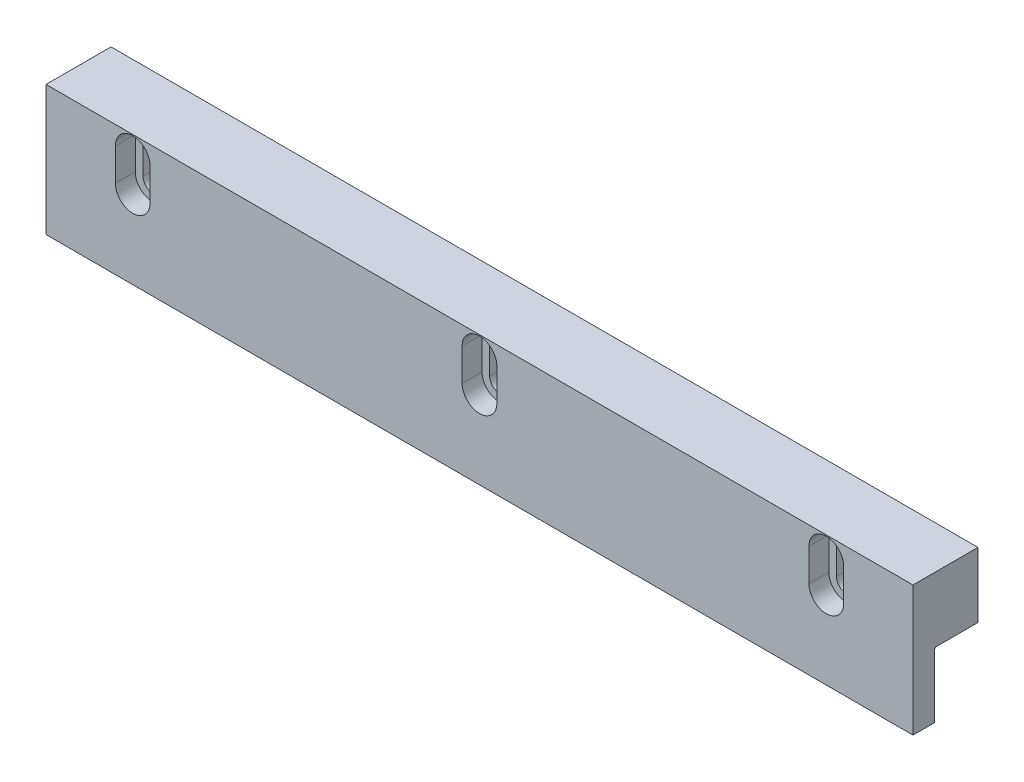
ISO-10303-21;
HEADER;
FILE_DESCRIPTION(('STEP AP214'),'2;1');
FILE_NAME('part.step','',(''),(''),'','','');
FILE_SCHEMA(('AUTOMOTIVE_DESIGN { 1 0 10303 214 1 1 1 1 }'));
ENDSEC;
DATA;
#1=APPLICATION_CONTEXT('core data for automotive mechanical design processes');
#2=APPLICATION_PROTOCOL_DEFINITION('international standard','automotive_design',2000,#1);
#3=PRODUCT_CONTEXT('',#1,'mechanical');
#4=PRODUCT('Part','Part','',(#3));
#5=PRODUCT_RELATED_PRODUCT_CATEGORY('part','',(#4));
#6=PRODUCT_DEFINITION_FORMATION('','',#4);
#7=PRODUCT_DEFINITION_CONTEXT('part definition',#1,'design');
#8=PRODUCT_DEFINITION('design','',#6,#7);
#9=PRODUCT_DEFINITION_SHAPE('','',#8);
#10=(LENGTH_UNIT() NAMED_UNIT(*) SI_UNIT(.MILLI.,.METRE.));
#11=(NAMED_UNIT(*) PLANE_ANGLE_UNIT() SI_UNIT($,.RADIAN.));
#12=(NAMED_UNIT(*) SI_UNIT($,.STERADIAN.) SOLID_ANGLE_UNIT());
#13=UNCERTAINTY_MEASURE_WITH_UNIT(LENGTH_MEASURE(1.E-05),#10,'distance_accuracy_value','');
#14=(GEOMETRIC_REPRESENTATION_CONTEXT(3) GLOBAL_UNCERTAINTY_ASSIGNED_CONTEXT((#13)) GLOBAL_UNIT_ASSIGNED_CONTEXT((#10,
#11,#12)) REPRESENTATION_CONTEXT('',''));
#15=CARTESIAN_POINT('',(0.,0.,0.));
#16=DIRECTION('',(0.,0.,1.));
#17=DIRECTION('',(1.,0.,0.));
#18=AXIS2_PLACEMENT_3D('',#15,#16,#17);
#19=CARTESIAN_POINT('',(0.,0.,15.));
#20=DIRECTION('',(0.,0.,1.));
#21=DIRECTION('',(1.,0.,0.));
#22=AXIS2_PLACEMENT_3D('',#19,#20,#21);
#23=PLANE('',#22);
#24=DIRECTION('',(0.,-1.,0.));
#25=VECTOR('',#24,1.);
#26=CARTESIAN_POINT('',(53.3117965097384,43.,15.));
#27=LINE('',#26,#25);
#28=CARTESIAN_POINT('',(53.3117965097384,43.,15.));
#29=VERTEX_POINT('',#28);
#30=CARTESIAN_POINT('',(53.3117965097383,13.,15.));
#31=VERTEX_POINT('',#30);
#32=EDGE_CURVE('E414',#29,#31,#27,.T.);
#33=ORIENTED_EDGE('',*,*,#32,.T.);
#34=DIRECTION('',(1.,0.,0.));
#35=VECTOR('',#34,1.);
#36=CARTESIAN_POINT('',(53.3117965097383,13.,15.));
#37=LINE('',#36,#35);
#38=CARTESIAN_POINT('',(253.311796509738,13.,15.));
#39=VERTEX_POINT('',#38);
#40=EDGE_CURVE('E417',#31,#39,#37,.T.);
#41=ORIENTED_EDGE('',*,*,#40,.T.);
#42=DIRECTION('',(0.,1.,0.));
#43=VECTOR('',#42,1.);
#44=CARTESIAN_POINT('',(253.311796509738,43.,15.));
#45=LINE('',#44,#43);
#46=CARTESIAN_POINT('',(253.311796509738,43.,15.));
#47=VERTEX_POINT('',#46);
#48=EDGE_CURVE('E420',#39,#47,#45,.T.);
#49=ORIENTED_EDGE('',*,*,#48,.T.);
#50=DIRECTION('',(-1.,0.,0.));
#51=VECTOR('',#50,1.);
#52=CARTESIAN_POINT('',(53.3117965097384,43.,15.));
#53=LINE('',#52,#51);
#54=EDGE_CURVE('E422',#47,#29,#53,.T.);
#55=ORIENTED_EDGE('',*,*,#54,.T.);
#56=EDGE_LOOP('',(#33,#41,#49,#55));
#57=FACE_BOUND('',#56,.T.);
#58=CARTESIAN_POINT('',(233.311796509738,38.75,15.));
#59=DIRECTION('',(0.,0.,1.));
#60=DIRECTION('',(1.,0.,0.));
#61=AXIS2_PLACEMENT_3D('',#58,#59,#60);
#62=CIRCLE('',#61,4.);
#63=CARTESIAN_POINT('',(237.311796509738,38.75,15.));
#64=VERTEX_POINT('',#63);
#65=CARTESIAN_POINT('',(229.311796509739,38.75,15.));
#66=VERTEX_POINT('',#65);
#67=EDGE_CURVE('E363',#64,#66,#62,.T.);
#68=ORIENTED_EDGE('',*,*,#67,.F.);
#69=DIRECTION('',(0.,-1.,0.));
#70=VECTOR('',#69,1.);
#71=CARTESIAN_POINT('',(237.311796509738,38.75,15.));
#72=LINE('',#71,#70);
#73=CARTESIAN_POINT('',(237.311796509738,31.25,15.));
#74=VERTEX_POINT('',#73);
#75=EDGE_CURVE('E351',#64,#74,#72,.T.);
#76=ORIENTED_EDGE('',*,*,#75,.T.);
#77=CARTESIAN_POINT('',(233.311796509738,31.25,15.));
#78=DIRECTION('',(0.,0.,1.));
#79=DIRECTION('',(1.,0.,0.));
#80=AXIS2_PLACEMENT_3D('',#77,#78,#79);
#81=CIRCLE('',#80,4.);
#82=CARTESIAN_POINT('',(229.311796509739,31.25,15.));
#83=VERTEX_POINT('',#82);
#84=EDGE_CURVE('E384',#83,#74,#81,.T.);
#85=ORIENTED_EDGE('',*,*,#84,.F.);
#86=DIRECTION('',(0.,-1.,0.));
#87=VECTOR('',#86,1.);
#88=CARTESIAN_POINT('',(229.311796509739,38.75,15.));
#89=LINE('',#88,#87);
#90=EDGE_CURVE('E334',#66,#83,#89,.T.);
#91=ORIENTED_EDGE('',*,*,#90,.F.);
#92=EDGE_LOOP('',(#68,#76,#85,#91));
#93=FACE_BOUND('',#92,.T.);
#94=CARTESIAN_POINT('',(153.311796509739,38.75,15.));
#95=DIRECTION('',(0.,0.,1.));
#96=DIRECTION('',(1.,0.,0.));
#97=AXIS2_PLACEMENT_3D('',#94,#95,#96);
#98=CIRCLE('',#97,4.);
#99=CARTESIAN_POINT('',(157.311796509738,38.75,15.));
#100=VERTEX_POINT('',#99);
#101=CARTESIAN_POINT('',(149.311796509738,38.75,15.));
#102=VERTEX_POINT('',#101);
#103=EDGE_CURVE('E299',#100,#102,#98,.T.);
#104=ORIENTED_EDGE('',*,*,#103,.F.);
#105=DIRECTION('',(0.,-1.,0.));
#106=VECTOR('',#105,1.);
#107=CARTESIAN_POINT('',(157.311796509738,38.75,15.));
#108=LINE('',#107,#106);
#109=CARTESIAN_POINT('',(157.311796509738,31.25,15.));
#110=VERTEX_POINT('',#109);
#111=EDGE_CURVE('E287',#100,#110,#108,.T.);
#112=ORIENTED_EDGE('',*,*,#111,.T.);
#113=CARTESIAN_POINT('',(153.311796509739,31.25,15.));
#114=DIRECTION('',(0.,0.,1.));
#115=DIRECTION('',(1.,0.,0.));
#116=AXIS2_PLACEMENT_3D('',#113,#114,#115);
#117=CIRCLE('',#116,4.);
#118=CARTESIAN_POINT('',(149.311796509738,31.25,15.));
#119=VERTEX_POINT('',#118);
#120=EDGE_CURVE('E320',#119,#110,#117,.T.);
#121=ORIENTED_EDGE('',*,*,#120,.F.);
#122=DIRECTION('',(0.,-1.,0.));
#123=VECTOR('',#122,1.);
#124=CARTESIAN_POINT('',(149.311796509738,38.75,15.));
#125=LINE('',#124,#123);
#126=EDGE_CURVE('E270',#102,#119,#125,.T.);
#127=ORIENTED_EDGE('',*,*,#126,.F.);
#128=EDGE_LOOP('',(#104,#112,#121,#127));
#129=FACE_BOUND('',#128,.T.);
#130=CARTESIAN_POINT('',(73.3117965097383,38.75,15.));
#131=DIRECTION('',(0.,0.,1.));
#132=DIRECTION('',(1.,0.,0.));
#133=AXIS2_PLACEMENT_3D('',#130,#131,#132);
#134=CIRCLE('',#133,4.);
#135=CARTESIAN_POINT('',(77.3117965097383,38.75,15.));
#136=VERTEX_POINT('',#135);
#137=CARTESIAN_POINT('',(69.3117965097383,38.75,15.));
#138=VERTEX_POINT('',#137);
#139=EDGE_CURVE('E31',#136,#138,#134,.T.);
#140=ORIENTED_EDGE('',*,*,#139,.F.);
#141=DIRECTION('',(0.,-1.,0.));
#142=VECTOR('',#141,1.);
#143=CARTESIAN_POINT('',(77.3117965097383,38.75,15.));
#144=LINE('',#143,#142);
#145=CARTESIAN_POINT('',(77.3117965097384,31.25,15.));
#146=VERTEX_POINT('',#145);
#147=EDGE_CURVE('E222',#136,#146,#144,.T.);
#148=ORIENTED_EDGE('',*,*,#147,.T.);
#149=CARTESIAN_POINT('',(73.3117965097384,31.25,15.));
#150=DIRECTION('',(0.,0.,1.));
#151=DIRECTION('',(1.,0.,0.));
#152=AXIS2_PLACEMENT_3D('',#149,#150,#151);
#153=CIRCLE('',#152,4.);
#154=CARTESIAN_POINT('',(69.3117965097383,31.25,15.));
#155=VERTEX_POINT('',#154);
#156=EDGE_CURVE('E258',#155,#146,#153,.T.);
#157=ORIENTED_EDGE('',*,*,#156,.F.);
#158=DIRECTION('',(0.,-1.,0.));
#159=VECTOR('',#158,1.);
#160=CARTESIAN_POINT('',(69.3117965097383,38.75,15.));
#161=LINE('',#160,#159);
#162=EDGE_CURVE('E239',#138,#155,#161,.T.);
#163=ORIENTED_EDGE('',*,*,#162,.F.);
#164=EDGE_LOOP('',(#140,#148,#157,#163));
#165=FACE_BOUND('',#164,.T.);
#166=ADVANCED_FACE('F16',(#57,#93,#129,#165),#23,.T.);
#167=CARTESIAN_POINT('',(0.,0.,0.));
#168=DIRECTION('',(0.,0.,1.));
#169=DIRECTION('',(1.,0.,0.));
#170=AXIS2_PLACEMENT_3D('',#167,#168,#169);
#171=PLANE('',#170);
#172=DIRECTION('',(0.,-1.,0.));
#173=VECTOR('',#172,1.);
#174=CARTESIAN_POINT('',(155.561796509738,38.75,0.));
#175=LINE('',#174,#173);
#176=CARTESIAN_POINT('',(155.561796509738,38.75,0.));
#177=VERTEX_POINT('',#176);
#178=CARTESIAN_POINT('',(155.561796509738,31.25,0.));
#179=VERTEX_POINT('',#178);
#180=EDGE_CURVE('E279',#177,#179,#175,.T.);
#181=ORIENTED_EDGE('',*,*,#180,.F.);
#182=CARTESIAN_POINT('',(153.311796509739,38.75,0.));
#183=DIRECTION('',(0.,0.,1.));
#184=DIRECTION('',(1.,0.,0.));
#185=AXIS2_PLACEMENT_3D('',#182,#183,#184);
#186=CIRCLE('',#185,2.25);
#187=CARTESIAN_POINT('',(151.061796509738,38.75,0.));
#188=VERTEX_POINT('',#187);
#189=EDGE_CURVE('E307',#177,#188,#186,.T.);
#190=ORIENTED_EDGE('',*,*,#189,.T.);
#191=DIRECTION('',(0.,-1.,0.));
#192=VECTOR('',#191,1.);
#193=CARTESIAN_POINT('',(151.061796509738,38.75,0.));
#194=LINE('',#193,#192);
#195=CARTESIAN_POINT('',(151.061796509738,31.25,0.));
#196=VERTEX_POINT('',#195);
#197=EDGE_CURVE('E276',#188,#196,#194,.T.);
#198=ORIENTED_EDGE('',*,*,#197,.T.);
#199=CARTESIAN_POINT('',(153.311796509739,31.25,0.));
#200=DIRECTION('',(0.,0.,1.));
#201=DIRECTION('',(1.,0.,0.));
#202=AXIS2_PLACEMENT_3D('',#199,#200,#201);
#203=CIRCLE('',#202,2.25);
#204=EDGE_CURVE('E328',#196,#179,#203,.T.);
#205=ORIENTED_EDGE('',*,*,#204,.T.);
#206=EDGE_LOOP('',(#181,#190,#198,#205));
#207=FACE_BOUND('',#206,.T.);
#208=DIRECTION('',(0.,1.,0.));
#209=VECTOR('',#208,1.);
#210=CARTESIAN_POINT('',(253.311796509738,43.,0.));
#211=LINE('',#210,#209);
#212=CARTESIAN_POINT('',(253.311796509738,28.,0.));
#213=VERTEX_POINT('',#212);
#214=CARTESIAN_POINT('',(253.311796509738,43.,0.));
#215=VERTEX_POINT('',#214);
#216=EDGE_CURVE('E427',#213,#215,#211,.T.);
#217=ORIENTED_EDGE('',*,*,#216,.F.);
#218=DIRECTION('',(1.,0.,0.));
#219=VECTOR('',#218,1.);
#220=CARTESIAN_POINT('',(53.3117965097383,28.,0.));
#221=LINE('',#220,#219);
#222=CARTESIAN_POINT('',(53.3117965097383,28.,0.));
#223=VERTEX_POINT('',#222);
#224=EDGE_CURVE('E405',#223,#213,#221,.T.);
#225=ORIENTED_EDGE('',*,*,#224,.F.);
#226=DIRECTION('',(0.,-1.,0.));
#227=VECTOR('',#226,1.);
#228=CARTESIAN_POINT('',(53.3117965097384,43.,0.));
#229=LINE('',#228,#227);
#230=CARTESIAN_POINT('',(53.3117965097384,43.,0.));
#231=VERTEX_POINT('',#230);
#232=EDGE_CURVE('E412',#231,#223,#229,.T.);
#233=ORIENTED_EDGE('',*,*,#232,.F.);
#234=DIRECTION('',(-1.,0.,0.));
#235=VECTOR('',#234,1.);
#236=CARTESIAN_POINT('',(53.3117965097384,43.,0.));
#237=LINE('',#236,#235);
#238=EDGE_CURVE('E418',#215,#231,#237,.T.);
#239=ORIENTED_EDGE('',*,*,#238,.F.);
#240=EDGE_LOOP('',(#217,#225,#233,#239));
#241=FACE_BOUND('',#240,.T.);
#242=DIRECTION('',(0.,-1.,0.));
#243=VECTOR('',#242,1.);
#244=CARTESIAN_POINT('',(235.561796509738,38.75,0.));
#245=LINE('',#244,#243);
#246=CARTESIAN_POINT('',(235.561796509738,38.75,0.));
#247=VERTEX_POINT('',#246);
#248=CARTESIAN_POINT('',(235.561796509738,31.25,0.));
#249=VERTEX_POINT('',#248);
#250=EDGE_CURVE('E343',#247,#249,#245,.T.);
#251=ORIENTED_EDGE('',*,*,#250,.F.);
#252=CARTESIAN_POINT('',(233.311796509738,38.75,0.));
#253=DIRECTION('',(0.,0.,1.));
#254=DIRECTION('',(1.,0.,0.));
#255=AXIS2_PLACEMENT_3D('',#252,#253,#254);
#256=CIRCLE('',#255,2.25);
#257=CARTESIAN_POINT('',(231.061796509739,38.75,0.));
#258=VERTEX_POINT('',#257);
#259=EDGE_CURVE('E371',#247,#258,#256,.T.);
#260=ORIENTED_EDGE('',*,*,#259,.T.);
#261=DIRECTION('',(0.,-1.,0.));
#262=VECTOR('',#261,1.);
#263=CARTESIAN_POINT('',(231.061796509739,38.75,0.));
#264=LINE('',#263,#262);
#265=CARTESIAN_POINT('',(231.061796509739,31.25,0.));
#266=VERTEX_POINT('',#265);
#267=EDGE_CURVE('E340',#258,#266,#264,.T.);
#268=ORIENTED_EDGE('',*,*,#267,.T.);
#269=CARTESIAN_POINT('',(233.311796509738,31.25,0.));
#270=DIRECTION('',(0.,0.,1.));
#271=DIRECTION('',(1.,0.,0.));
#272=AXIS2_PLACEMENT_3D('',#269,#270,#271);
#273=CIRCLE('',#272,2.25);
#274=EDGE_CURVE('E392',#266,#249,#273,.T.);
#275=ORIENTED_EDGE('',*,*,#274,.T.);
#276=EDGE_LOOP('',(#251,#260,#268,#275));
#277=FACE_BOUND('',#276,.T.);
#278=DIRECTION('',(0.,-1.,0.));
#279=VECTOR('',#278,1.);
#280=CARTESIAN_POINT('',(75.5617965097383,38.75,0.));
#281=LINE('',#280,#279);
#282=CARTESIAN_POINT('',(75.5617965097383,38.75,0.));
#283=VERTEX_POINT('',#282);
#284=CARTESIAN_POINT('',(75.5617965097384,31.25,0.));
#285=VERTEX_POINT('',#284);
#286=EDGE_CURVE('E488',#283,#285,#281,.T.);
#287=ORIENTED_EDGE('',*,*,#286,.F.);
#288=CARTESIAN_POINT('',(73.3117965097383,38.75,0.));
#289=DIRECTION('',(0.,0.,1.));
#290=DIRECTION('',(1.,0.,0.));
#291=AXIS2_PLACEMENT_3D('',#288,#289,#290);
#292=CIRCLE('',#291,2.25);
#293=CARTESIAN_POINT('',(71.0617965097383,38.75,0.));
#294=VERTEX_POINT('',#293);
#295=EDGE_CURVE('E248',#283,#294,#292,.T.);
#296=ORIENTED_EDGE('',*,*,#295,.T.);
#297=DIRECTION('',(0.,-1.,0.));
#298=VECTOR('',#297,1.);
#299=CARTESIAN_POINT('',(71.0617965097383,38.75,0.));
#300=LINE('',#299,#298);
#301=CARTESIAN_POINT('',(71.0617965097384,31.25,0.));
#302=VERTEX_POINT('',#301);
#303=EDGE_CURVE('E493',#294,#302,#300,.T.);
#304=ORIENTED_EDGE('',*,*,#303,.T.);
#305=CARTESIAN_POINT('',(73.3117965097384,31.25,0.));
#306=DIRECTION('',(0.,0.,1.));
#307=DIRECTION('',(1.,0.,0.));
#308=AXIS2_PLACEMENT_3D('',#305,#306,#307);
#309=CIRCLE('',#308,2.25);
#310=EDGE_CURVE('E39',#302,#285,#309,.T.);
#311=ORIENTED_EDGE('',*,*,#310,.T.);
#312=EDGE_LOOP('',(#287,#296,#304,#311));
#313=FACE_BOUND('',#312,.T.);
#314=ADVANCED_FACE('F479',(#207,#241,#277,#313),#171,.F.);
#315=CARTESIAN_POINT('',(53.3117965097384,43.,15.));
#316=DIRECTION('',(1.,0.,0.));
#317=DIRECTION('',(0.,1.,0.));
#318=AXIS2_PLACEMENT_3D('',#315,#316,#317);
#319=PLANE('',#318);
#320=DIRECTION('',(0.,0.,1.));
#321=VECTOR('',#320,1.);
#322=CARTESIAN_POINT('',(53.3117965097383,28.,0.));
#323=LINE('',#322,#321);
#324=CARTESIAN_POINT('',(53.3117965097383,28.,9.5));
#325=VERTEX_POINT('',#324);
#326=EDGE_CURVE('E399',#223,#325,#323,.T.);
#327=ORIENTED_EDGE('',*,*,#326,.T.);
#328=CARTESIAN_POINT('',(53.3117965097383,27.5,9.5));
#329=DIRECTION('',(1.,0.,0.));
#330=DIRECTION('',(0.,1.,0.));
#331=AXIS2_PLACEMENT_3D('',#328,#329,#330);
#332=CIRCLE('',#331,0.5);
#333=CARTESIAN_POINT('',(53.3117965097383,27.5,10.));
#334=VERTEX_POINT('',#333);
#335=EDGE_CURVE('E11',#325,#334,#332,.T.);
#336=ORIENTED_EDGE('',*,*,#335,.T.);
#337=DIRECTION('',(0.,-1.,0.));
#338=VECTOR('',#337,1.);
#339=CARTESIAN_POINT('',(53.3117965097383,13.,10.));
#340=LINE('',#339,#338);
#341=CARTESIAN_POINT('',(53.3117965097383,13.,10.));
#342=VERTEX_POINT('',#341);
#343=EDGE_CURVE('E402',#334,#342,#340,.T.);
#344=ORIENTED_EDGE('',*,*,#343,.T.);
#345=DIRECTION('',(0.,0.,-1.));
#346=VECTOR('',#345,1.);
#347=CARTESIAN_POINT('',(53.3117965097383,13.,15.));
#348=LINE('',#347,#346);
#349=EDGE_CURVE('E438',#31,#342,#348,.T.);
#350=ORIENTED_EDGE('',*,*,#349,.F.);
#351=ORIENTED_EDGE('',*,*,#32,.F.);
#352=DIRECTION('',(0.,0.,-1.));
#353=VECTOR('',#352,1.);
#354=CARTESIAN_POINT('',(53.3117965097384,43.,15.));
#355=LINE('',#354,#353);
#356=EDGE_CURVE('E424',#29,#231,#355,.T.);
#357=ORIENTED_EDGE('',*,*,#356,.T.);
#358=ORIENTED_EDGE('',*,*,#232,.T.);
#359=EDGE_LOOP('',(#327,#336,#344,#350,#351,#357,#358));
#360=FACE_BOUND('',#359,.T.);
#361=ADVANCED_FACE('F459',(#360),#319,.F.);
#362=CARTESIAN_POINT('',(53.3117965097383,13.,15.));
#363=DIRECTION('',(0.,1.,0.));
#364=DIRECTION('',(0.,0.,1.));
#365=AXIS2_PLACEMENT_3D('',#362,#363,#364);
#366=PLANE('',#365);
#367=ORIENTED_EDGE('',*,*,#349,.T.);
#368=DIRECTION('',(1.,0.,0.));
#369=VECTOR('',#368,1.);
#370=CARTESIAN_POINT('',(53.3117965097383,13.,10.));
#371=LINE('',#370,#369);
#372=CARTESIAN_POINT('',(253.311796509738,13.,10.));
#373=VERTEX_POINT('',#372);
#374=EDGE_CURVE('E409',#342,#373,#371,.T.);
#375=ORIENTED_EDGE('',*,*,#374,.T.);
#376=DIRECTION('',(0.,0.,-1.));
#377=VECTOR('',#376,1.);
#378=CARTESIAN_POINT('',(253.311796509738,13.,15.));
#379=LINE('',#378,#377);
#380=EDGE_CURVE('E435',#39,#373,#379,.T.);
#381=ORIENTED_EDGE('',*,*,#380,.F.);
#382=ORIENTED_EDGE('',*,*,#40,.F.);
#383=EDGE_LOOP('',(#367,#375,#381,#382));
#384=FACE_BOUND('',#383,.T.);
#385=ADVANCED_FACE('F466',(#384),#366,.F.);
#386=CARTESIAN_POINT('',(253.311796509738,43.,15.));
#387=DIRECTION('',(-1.,0.,0.));
#388=DIRECTION('',(0.,0.,1.));
#389=AXIS2_PLACEMENT_3D('',#386,#387,#388);
#390=PLANE('',#389);
#391=ORIENTED_EDGE('',*,*,#380,.T.);
#392=DIRECTION('',(0.,-1.,0.));
#393=VECTOR('',#392,1.);
#394=CARTESIAN_POINT('',(253.311796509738,13.,10.));
#395=LINE('',#394,#393);
#396=CARTESIAN_POINT('',(253.311796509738,27.5,10.));
#397=VERTEX_POINT('',#396);
#398=EDGE_CURVE('E403',#397,#373,#395,.T.);
#399=ORIENTED_EDGE('',*,*,#398,.F.);
#400=CARTESIAN_POINT('',(253.311796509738,27.5,9.5));
#401=DIRECTION('',(-1.,0.,0.));
#402=DIRECTION('',(0.,0.,1.));
#403=AXIS2_PLACEMENT_3D('',#400,#401,#402);
#404=CIRCLE('',#403,0.5);
#405=CARTESIAN_POINT('',(253.311796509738,28.,9.5));
#406=VERTEX_POINT('',#405);
#407=EDGE_CURVE('E24',#397,#406,#404,.T.);
#408=ORIENTED_EDGE('',*,*,#407,.T.);
#409=DIRECTION('',(0.,0.,1.));
#410=VECTOR('',#409,1.);
#411=CARTESIAN_POINT('',(253.311796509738,28.,0.));
#412=LINE('',#411,#410);
#413=EDGE_CURVE('E398',#213,#406,#412,.T.);
#414=ORIENTED_EDGE('',*,*,#413,.F.);
#415=ORIENTED_EDGE('',*,*,#216,.T.);
#416=DIRECTION('',(0.,0.,-1.));
#417=VECTOR('',#416,1.);
#418=CARTESIAN_POINT('',(253.311796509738,43.,15.));
#419=LINE('',#418,#417);
#420=EDGE_CURVE('E432',#47,#215,#419,.T.);
#421=ORIENTED_EDGE('',*,*,#420,.F.);
#422=ORIENTED_EDGE('',*,*,#48,.F.);
#423=EDGE_LOOP('',(#391,#399,#408,#414,#415,#421,#422));
#424=FACE_BOUND('',#423,.T.);
#425=ADVANCED_FACE('F448',(#424),#390,.F.);
#426=CARTESIAN_POINT('',(53.3117965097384,43.,15.));
#427=DIRECTION('',(0.,-1.,0.));
#428=DIRECTION('',(0.,0.,-1.));
#429=AXIS2_PLACEMENT_3D('',#426,#427,#428);
#430=PLANE('',#429);
#431=ORIENTED_EDGE('',*,*,#238,.T.);
#432=ORIENTED_EDGE('',*,*,#356,.F.);
#433=ORIENTED_EDGE('',*,*,#54,.F.);
#434=ORIENTED_EDGE('',*,*,#420,.T.);
#435=EDGE_LOOP('',(#431,#432,#433,#434));
#436=FACE_BOUND('',#435,.T.);
#437=ADVANCED_FACE('F476',(#436),#430,.F.);
#438=CARTESIAN_POINT('',(53.3117965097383,13.,10.));
#439=DIRECTION('',(0.,0.,1.));
#440=DIRECTION('',(1.,0.,0.));
#441=AXIS2_PLACEMENT_3D('',#438,#439,#440);
#442=PLANE('',#441);
#443=ORIENTED_EDGE('',*,*,#343,.F.);
#444=DIRECTION('',(1.,0.,0.));
#445=VECTOR('',#444,1.);
#446=CARTESIAN_POINT('',(253.311796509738,27.5,10.));
#447=LINE('',#446,#445);
#448=EDGE_CURVE('E441',#334,#397,#447,.T.);
#449=ORIENTED_EDGE('',*,*,#448,.T.);
#450=ORIENTED_EDGE('',*,*,#398,.T.);
#451=ORIENTED_EDGE('',*,*,#374,.F.);
#452=EDGE_LOOP('',(#443,#449,#450,#451));
#453=FACE_BOUND('',#452,.T.);
#454=ADVANCED_FACE('F463',(#453),#442,.F.);
#455=CARTESIAN_POINT('',(53.3117965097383,28.,0.));
#456=DIRECTION('',(0.,1.,0.));
#457=DIRECTION('',(0.,0.,1.));
#458=AXIS2_PLACEMENT_3D('',#455,#456,#457);
#459=PLANE('',#458);
#460=ORIENTED_EDGE('',*,*,#413,.T.);
#461=DIRECTION('',(1.,0.,0.));
#462=VECTOR('',#461,1.);
#463=CARTESIAN_POINT('',(53.3117965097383,28.,9.5));
#464=LINE('',#463,#462);
#465=EDGE_CURVE('E444',#406,#325,#464,.F.);
#466=ORIENTED_EDGE('',*,*,#465,.T.);
#467=ORIENTED_EDGE('',*,*,#326,.F.);
#468=ORIENTED_EDGE('',*,*,#224,.T.);
#469=EDGE_LOOP('',(#460,#466,#467,#468));
#470=FACE_BOUND('',#469,.T.);
#471=ADVANCED_FACE('F454',(#470),#459,.F.);
#472=CARTESIAN_POINT('',(53.3117965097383,27.5,9.5));
#473=DIRECTION('',(-1.,0.,0.));
#474=DIRECTION('',(0.,0.,1.));
#475=AXIS2_PLACEMENT_3D('',#472,#473,#474);
#476=CYLINDRICAL_SURFACE('',#475,0.5);
#477=ORIENTED_EDGE('',*,*,#335,.F.);
#478=ORIENTED_EDGE('',*,*,#465,.F.);
#479=ORIENTED_EDGE('',*,*,#407,.F.);
#480=ORIENTED_EDGE('',*,*,#448,.F.);
#481=EDGE_LOOP('',(#477,#478,#479,#480));
#482=FACE_BOUND('',#481,.T.);
#483=ADVANCED_FACE('F18',(#482),#476,.F.);
#484=CARTESIAN_POINT('',(233.311796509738,31.25,15.));
#485=DIRECTION('',(0.,0.,1.));
#486=DIRECTION('',(1.,0.,0.));
#487=AXIS2_PLACEMENT_3D('',#484,#485,#486);
#488=CYLINDRICAL_SURFACE('',#487,2.25);
#489=CARTESIAN_POINT('',(233.311796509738,31.25,10.4));
#490=DIRECTION('',(0.,0.,1.));
#491=DIRECTION('',(1.,0.,0.));
#492=AXIS2_PLACEMENT_3D('',#489,#490,#491);
#493=CIRCLE('',#492,2.25);
#494=CARTESIAN_POINT('',(231.061796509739,31.25,10.4));
#495=VERTEX_POINT('',#494);
#496=CARTESIAN_POINT('',(235.561796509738,31.25,10.4));
#497=VERTEX_POINT('',#496);
#498=EDGE_CURVE('E389',#495,#497,#493,.T.);
#499=ORIENTED_EDGE('',*,*,#498,.T.);
#500=DIRECTION('',(0.,0.,-1.));
#501=VECTOR('',#500,1.);
#502=CARTESIAN_POINT('',(235.561796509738,31.25,0.));
#503=LINE('',#502,#501);
#504=EDGE_CURVE('E382',#497,#249,#503,.T.);
#505=ORIENTED_EDGE('',*,*,#504,.T.);
#506=ORIENTED_EDGE('',*,*,#274,.F.);
#507=DIRECTION('',(0.,0.,1.));
#508=VECTOR('',#507,1.);
#509=CARTESIAN_POINT('',(231.061796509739,31.25,15.));
#510=LINE('',#509,#508);
#511=EDGE_CURVE('E377',#495,#266,#510,.F.);
#512=ORIENTED_EDGE('',*,*,#511,.F.);
#513=EDGE_LOOP('',(#499,#505,#506,#512));
#514=FACE_BOUND('',#513,.T.);
#515=ADVANCED_FACE('F591',(#514),#488,.F.);
#516=CARTESIAN_POINT('',(235.561796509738,31.25,10.4));
#517=DIRECTION('',(0.,0.,-1.));
#518=DIRECTION('',(-1.,0.,0.));
#519=AXIS2_PLACEMENT_3D('',#516,#517,#518);
#520=PLANE('',#519);
#521=ORIENTED_EDGE('',*,*,#498,.F.);
#522=DIRECTION('',(0.,-1.,0.));
#523=VECTOR('',#522,1.);
#524=CARTESIAN_POINT('',(231.061796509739,38.75,10.4));
#525=LINE('',#524,#523);
#526=CARTESIAN_POINT('',(231.061796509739,38.75,10.4));
#527=VERTEX_POINT('',#526);
#528=EDGE_CURVE('E338',#527,#495,#525,.T.);
#529=ORIENTED_EDGE('',*,*,#528,.F.);
#530=CARTESIAN_POINT('',(233.311796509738,38.75,10.4));
#531=DIRECTION('',(0.,0.,1.));
#532=DIRECTION('',(1.,0.,0.));
#533=AXIS2_PLACEMENT_3D('',#530,#531,#532);
#534=CIRCLE('',#533,2.25);
#535=CARTESIAN_POINT('',(235.561796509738,38.75,10.4));
#536=VERTEX_POINT('',#535);
#537=EDGE_CURVE('E368',#536,#527,#534,.T.);
#538=ORIENTED_EDGE('',*,*,#537,.F.);
#539=DIRECTION('',(0.,-1.,0.));
#540=VECTOR('',#539,1.);
#541=CARTESIAN_POINT('',(235.561796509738,38.75,10.4));
#542=LINE('',#541,#540);
#543=EDGE_CURVE('E346',#536,#497,#542,.T.);
#544=ORIENTED_EDGE('',*,*,#543,.T.);
#545=EDGE_LOOP('',(#521,#529,#538,#544));
#546=FACE_BOUND('',#545,.T.);
#547=CARTESIAN_POINT('',(233.311796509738,31.25,10.4));
#548=DIRECTION('',(0.,0.,1.));
#549=DIRECTION('',(1.,0.,0.));
#550=AXIS2_PLACEMENT_3D('',#547,#548,#549);
#551=CIRCLE('',#550,4.);
#552=CARTESIAN_POINT('',(229.311796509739,31.25,10.4));
#553=VERTEX_POINT('',#552);
#554=CARTESIAN_POINT('',(237.311796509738,31.25,10.4));
#555=VERTEX_POINT('',#554);
#556=EDGE_CURVE('E386',#553,#555,#551,.T.);
#557=ORIENTED_EDGE('',*,*,#556,.T.);
#558=DIRECTION('',(0.,-1.,0.));
#559=VECTOR('',#558,1.);
#560=CARTESIAN_POINT('',(237.311796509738,38.75,10.4));
#561=LINE('',#560,#559);
#562=CARTESIAN_POINT('',(237.311796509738,38.75,10.4));
#563=VERTEX_POINT('',#562);
#564=EDGE_CURVE('E348',#563,#555,#561,.T.);
#565=ORIENTED_EDGE('',*,*,#564,.F.);
#566=CARTESIAN_POINT('',(233.311796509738,38.75,10.4));
#567=DIRECTION('',(0.,0.,1.));
#568=DIRECTION('',(1.,0.,0.));
#569=AXIS2_PLACEMENT_3D('',#566,#567,#568);
#570=CIRCLE('',#569,4.);
#571=CARTESIAN_POINT('',(229.311796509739,38.75,10.4));
#572=VERTEX_POINT('',#571);
#573=EDGE_CURVE('E365',#563,#572,#570,.T.);
#574=ORIENTED_EDGE('',*,*,#573,.T.);
#575=DIRECTION('',(0.,-1.,0.));
#576=VECTOR('',#575,1.);
#577=CARTESIAN_POINT('',(229.311796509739,38.75,10.4));
#578=LINE('',#577,#576);
#579=EDGE_CURVE('E336',#572,#553,#578,.T.);
#580=ORIENTED_EDGE('',*,*,#579,.T.);
#581=EDGE_LOOP('',(#557,#565,#574,#580));
#582=FACE_BOUND('',#581,.T.);
#583=ADVANCED_FACE('F598',(#546,#582),#520,.F.);
#584=CARTESIAN_POINT('',(233.311796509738,31.25,15.));
#585=DIRECTION('',(0.,0.,1.));
#586=DIRECTION('',(1.,0.,0.));
#587=AXIS2_PLACEMENT_3D('',#584,#585,#586);
#588=CYLINDRICAL_SURFACE('',#587,4.);
#589=ORIENTED_EDGE('',*,*,#84,.T.);
#590=DIRECTION('',(0.,0.,-1.));
#591=VECTOR('',#590,1.);
#592=CARTESIAN_POINT('',(237.311796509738,31.25,10.4));
#593=LINE('',#592,#591);
#594=EDGE_CURVE('E380',#74,#555,#593,.T.);
#595=ORIENTED_EDGE('',*,*,#594,.T.);
#596=ORIENTED_EDGE('',*,*,#556,.F.);
#597=DIRECTION('',(0.,0.,1.));
#598=VECTOR('',#597,1.);
#599=CARTESIAN_POINT('',(229.311796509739,31.25,15.));
#600=LINE('',#599,#598);
#601=EDGE_CURVE('E395',#83,#553,#600,.F.);
#602=ORIENTED_EDGE('',*,*,#601,.F.);
#603=EDGE_LOOP('',(#589,#595,#596,#602));
#604=FACE_BOUND('',#603,.T.);
#605=ADVANCED_FACE('F607',(#604),#588,.F.);
#606=CARTESIAN_POINT('',(233.311796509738,38.75,15.));
#607=DIRECTION('',(0.,0.,1.));
#608=DIRECTION('',(1.,0.,0.));
#609=AXIS2_PLACEMENT_3D('',#606,#607,#608);
#610=CYLINDRICAL_SURFACE('',#609,2.25);
#611=ORIENTED_EDGE('',*,*,#259,.F.);
#612=DIRECTION('',(0.,0.,-1.));
#613=VECTOR('',#612,1.);
#614=CARTESIAN_POINT('',(235.561796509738,38.75,0.));
#615=LINE('',#614,#613);
#616=EDGE_CURVE('E360',#536,#247,#615,.T.);
#617=ORIENTED_EDGE('',*,*,#616,.F.);
#618=ORIENTED_EDGE('',*,*,#537,.T.);
#619=DIRECTION('',(0.,0.,1.));
#620=VECTOR('',#619,1.);
#621=CARTESIAN_POINT('',(231.061796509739,38.75,15.));
#622=LINE('',#621,#620);
#623=EDGE_CURVE('E354',#258,#527,#622,.T.);
#624=ORIENTED_EDGE('',*,*,#623,.F.);
#625=EDGE_LOOP('',(#611,#617,#618,#624));
#626=FACE_BOUND('',#625,.T.);
#627=ADVANCED_FACE('F616',(#626),#610,.F.);
#628=CARTESIAN_POINT('',(233.311796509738,38.75,15.));
#629=DIRECTION('',(0.,0.,1.));
#630=DIRECTION('',(1.,0.,0.));
#631=AXIS2_PLACEMENT_3D('',#628,#629,#630);
#632=CYLINDRICAL_SURFACE('',#631,4.);
#633=ORIENTED_EDGE('',*,*,#573,.F.);
#634=DIRECTION('',(0.,0.,-1.));
#635=VECTOR('',#634,1.);
#636=CARTESIAN_POINT('',(237.311796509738,38.75,10.4));
#637=LINE('',#636,#635);
#638=EDGE_CURVE('E357',#64,#563,#637,.T.);
#639=ORIENTED_EDGE('',*,*,#638,.F.);
#640=ORIENTED_EDGE('',*,*,#67,.T.);
#641=DIRECTION('',(0.,0.,1.));
#642=VECTOR('',#641,1.);
#643=CARTESIAN_POINT('',(229.311796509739,38.75,15.));
#644=LINE('',#643,#642);
#645=EDGE_CURVE('E374',#572,#66,#644,.T.);
#646=ORIENTED_EDGE('',*,*,#645,.F.);
#647=EDGE_LOOP('',(#633,#639,#640,#646));
#648=FACE_BOUND('',#647,.T.);
#649=ADVANCED_FACE('F625',(#648),#632,.F.);
#650=CARTESIAN_POINT('',(237.311796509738,38.75,10.4));
#651=DIRECTION('',(-1.,0.,0.));
#652=DIRECTION('',(0.,0.,1.));
#653=AXIS2_PLACEMENT_3D('',#650,#651,#652);
#654=PLANE('',#653);
#655=ORIENTED_EDGE('',*,*,#594,.F.);
#656=ORIENTED_EDGE('',*,*,#75,.F.);
#657=ORIENTED_EDGE('',*,*,#638,.T.);
#658=ORIENTED_EDGE('',*,*,#564,.T.);
#659=EDGE_LOOP('',(#655,#656,#657,#658));
#660=FACE_BOUND('',#659,.T.);
#661=ADVANCED_FACE('F634',(#660),#654,.T.);
#662=CARTESIAN_POINT('',(235.561796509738,38.75,0.));
#663=DIRECTION('',(-1.,0.,0.));
#664=DIRECTION('',(0.,0.,1.));
#665=AXIS2_PLACEMENT_3D('',#662,#663,#664);
#666=PLANE('',#665);
#667=ORIENTED_EDGE('',*,*,#504,.F.);
#668=ORIENTED_EDGE('',*,*,#543,.F.);
#669=ORIENTED_EDGE('',*,*,#616,.T.);
#670=ORIENTED_EDGE('',*,*,#250,.T.);
#671=EDGE_LOOP('',(#667,#668,#669,#670));
#672=FACE_BOUND('',#671,.T.);
#673=ADVANCED_FACE('F643',(#672),#666,.T.);
#674=CARTESIAN_POINT('',(231.061796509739,38.75,15.));
#675=DIRECTION('',(-1.,0.,0.));
#676=DIRECTION('',(0.,0.,1.));
#677=AXIS2_PLACEMENT_3D('',#674,#675,#676);
#678=PLANE('',#677);
#679=ORIENTED_EDGE('',*,*,#511,.T.);
#680=ORIENTED_EDGE('',*,*,#267,.F.);
#681=ORIENTED_EDGE('',*,*,#623,.T.);
#682=ORIENTED_EDGE('',*,*,#528,.T.);
#683=EDGE_LOOP('',(#679,#680,#681,#682));
#684=FACE_BOUND('',#683,.T.);
#685=ADVANCED_FACE('F652',(#684),#678,.F.);
#686=CARTESIAN_POINT('',(229.311796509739,38.75,15.));
#687=DIRECTION('',(-1.,0.,0.));
#688=DIRECTION('',(0.,0.,1.));
#689=AXIS2_PLACEMENT_3D('',#686,#687,#688);
#690=PLANE('',#689);
#691=ORIENTED_EDGE('',*,*,#601,.T.);
#692=ORIENTED_EDGE('',*,*,#579,.F.);
#693=ORIENTED_EDGE('',*,*,#645,.T.);
#694=ORIENTED_EDGE('',*,*,#90,.T.);
#695=EDGE_LOOP('',(#691,#692,#693,#694));
#696=FACE_BOUND('',#695,.T.);
#697=ADVANCED_FACE('F661',(#696),#690,.F.);
#698=CARTESIAN_POINT('',(153.311796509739,31.25,15.));
#699=DIRECTION('',(0.,0.,1.));
#700=DIRECTION('',(1.,0.,0.));
#701=AXIS2_PLACEMENT_3D('',#698,#699,#700);
#702=CYLINDRICAL_SURFACE('',#701,2.25);
#703=CARTESIAN_POINT('',(153.311796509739,31.25,10.4));
#704=DIRECTION('',(0.,0.,1.));
#705=DIRECTION('',(1.,0.,0.));
#706=AXIS2_PLACEMENT_3D('',#703,#704,#705);
#707=CIRCLE('',#706,2.25);
#708=CARTESIAN_POINT('',(151.061796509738,31.25,10.4));
#709=VERTEX_POINT('',#708);
#710=CARTESIAN_POINT('',(155.561796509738,31.25,10.4));
#711=VERTEX_POINT('',#710);
#712=EDGE_CURVE('E325',#709,#711,#707,.T.);
#713=ORIENTED_EDGE('',*,*,#712,.T.);
#714=DIRECTION('',(0.,0.,-1.));
#715=VECTOR('',#714,1.);
#716=CARTESIAN_POINT('',(155.561796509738,31.25,0.));
#717=LINE('',#716,#715);
#718=EDGE_CURVE('E318',#711,#179,#717,.T.);
#719=ORIENTED_EDGE('',*,*,#718,.T.);
#720=ORIENTED_EDGE('',*,*,#204,.F.);
#721=DIRECTION('',(0.,0.,1.));
#722=VECTOR('',#721,1.);
#723=CARTESIAN_POINT('',(151.061796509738,31.25,15.));
#724=LINE('',#723,#722);
#725=EDGE_CURVE('E313',#709,#196,#724,.F.);
#726=ORIENTED_EDGE('',*,*,#725,.F.);
#727=EDGE_LOOP('',(#713,#719,#720,#726));
#728=FACE_BOUND('',#727,.T.);
#729=ADVANCED_FACE('F670',(#728),#702,.F.);
#730=CARTESIAN_POINT('',(155.561796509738,31.25,10.4));
#731=DIRECTION('',(0.,0.,-1.));
#732=DIRECTION('',(-1.,0.,0.));
#733=AXIS2_PLACEMENT_3D('',#730,#731,#732);
#734=PLANE('',#733);
#735=ORIENTED_EDGE('',*,*,#712,.F.);
#736=DIRECTION('',(0.,-1.,0.));
#737=VECTOR('',#736,1.);
#738=CARTESIAN_POINT('',(151.061796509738,38.75,10.4));
#739=LINE('',#738,#737);
#740=CARTESIAN_POINT('',(151.061796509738,38.75,10.4));
#741=VERTEX_POINT('',#740);
#742=EDGE_CURVE('E274',#741,#709,#739,.T.);
#743=ORIENTED_EDGE('',*,*,#742,.F.);
#744=CARTESIAN_POINT('',(153.311796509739,38.75,10.4));
#745=DIRECTION('',(0.,0.,1.));
#746=DIRECTION('',(1.,0.,0.));
#747=AXIS2_PLACEMENT_3D('',#744,#745,#746);
#748=CIRCLE('',#747,2.25);
#749=CARTESIAN_POINT('',(155.561796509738,38.75,10.4));
#750=VERTEX_POINT('',#749);
#751=EDGE_CURVE('E304',#750,#741,#748,.T.);
#752=ORIENTED_EDGE('',*,*,#751,.F.);
#753=DIRECTION('',(0.,-1.,0.));
#754=VECTOR('',#753,1.);
#755=CARTESIAN_POINT('',(155.561796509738,38.75,10.4));
#756=LINE('',#755,#754);
#757=EDGE_CURVE('E282',#750,#711,#756,.T.);
#758=ORIENTED_EDGE('',*,*,#757,.T.);
#759=EDGE_LOOP('',(#735,#743,#752,#758));
#760=FACE_BOUND('',#759,.T.);
#761=CARTESIAN_POINT('',(153.311796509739,31.25,10.4));
#762=DIRECTION('',(0.,0.,1.));
#763=DIRECTION('',(1.,0.,0.));
#764=AXIS2_PLACEMENT_3D('',#761,#762,#763);
#765=CIRCLE('',#764,4.);
#766=CARTESIAN_POINT('',(149.311796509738,31.25,10.4));
#767=VERTEX_POINT('',#766);
#768=CARTESIAN_POINT('',(157.311796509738,31.25,10.4));
#769=VERTEX_POINT('',#768);
#770=EDGE_CURVE('E322',#767,#769,#765,.T.);
#771=ORIENTED_EDGE('',*,*,#770,.T.);
#772=DIRECTION('',(0.,-1.,0.));
#773=VECTOR('',#772,1.);
#774=CARTESIAN_POINT('',(157.311796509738,38.75,10.4));
#775=LINE('',#774,#773);
#776=CARTESIAN_POINT('',(157.311796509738,38.75,10.4));
#777=VERTEX_POINT('',#776);
#778=EDGE_CURVE('E284',#777,#769,#775,.T.);
#779=ORIENTED_EDGE('',*,*,#778,.F.);
#780=CARTESIAN_POINT('',(153.311796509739,38.75,10.4));
#781=DIRECTION('',(0.,0.,1.));
#782=DIRECTION('',(1.,0.,0.));
#783=AXIS2_PLACEMENT_3D('',#780,#781,#782);
#784=CIRCLE('',#783,4.);
#785=CARTESIAN_POINT('',(149.311796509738,38.75,10.4));
#786=VERTEX_POINT('',#785);
#787=EDGE_CURVE('E301',#777,#786,#784,.T.);
#788=ORIENTED_EDGE('',*,*,#787,.T.);
#789=DIRECTION('',(0.,-1.,0.));
#790=VECTOR('',#789,1.);
#791=CARTESIAN_POINT('',(149.311796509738,38.75,10.4));
#792=LINE('',#791,#790);
#793=EDGE_CURVE('E272',#786,#767,#792,.T.);
#794=ORIENTED_EDGE('',*,*,#793,.T.);
#795=EDGE_LOOP('',(#771,#779,#788,#794));
#796=FACE_BOUND('',#795,.T.);
#797=ADVANCED_FACE('F679',(#760,#796),#734,.F.);
#798=CARTESIAN_POINT('',(153.311796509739,31.25,15.));
#799=DIRECTION('',(0.,0.,1.));
#800=DIRECTION('',(1.,0.,0.));
#801=AXIS2_PLACEMENT_3D('',#798,#799,#800);
#802=CYLINDRICAL_SURFACE('',#801,4.);
#803=ORIENTED_EDGE('',*,*,#120,.T.);
#804=DIRECTION('',(0.,0.,-1.));
#805=VECTOR('',#804,1.);
#806=CARTESIAN_POINT('',(157.311796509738,31.25,10.4));
#807=LINE('',#806,#805);
#808=EDGE_CURVE('E316',#110,#769,#807,.T.);
#809=ORIENTED_EDGE('',*,*,#808,.T.);
#810=ORIENTED_EDGE('',*,*,#770,.F.);
#811=DIRECTION('',(0.,0.,1.));
#812=VECTOR('',#811,1.);
#813=CARTESIAN_POINT('',(149.311796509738,31.25,15.));
#814=LINE('',#813,#812);
#815=EDGE_CURVE('E331',#119,#767,#814,.F.);
#816=ORIENTED_EDGE('',*,*,#815,.F.);
#817=EDGE_LOOP('',(#803,#809,#810,#816));
#818=FACE_BOUND('',#817,.T.);
#819=ADVANCED_FACE('F688',(#818),#802,.F.);
#820=CARTESIAN_POINT('',(153.311796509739,38.75,15.));
#821=DIRECTION('',(0.,0.,1.));
#822=DIRECTION('',(1.,0.,0.));
#823=AXIS2_PLACEMENT_3D('',#820,#821,#822);
#824=CYLINDRICAL_SURFACE('',#823,2.25);
#825=ORIENTED_EDGE('',*,*,#189,.F.);
#826=DIRECTION('',(0.,0.,-1.));
#827=VECTOR('',#826,1.);
#828=CARTESIAN_POINT('',(155.561796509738,38.75,0.));
#829=LINE('',#828,#827);
#830=EDGE_CURVE('E296',#750,#177,#829,.T.);
#831=ORIENTED_EDGE('',*,*,#830,.F.);
#832=ORIENTED_EDGE('',*,*,#751,.T.);
#833=DIRECTION('',(0.,0.,1.));
#834=VECTOR('',#833,1.);
#835=CARTESIAN_POINT('',(151.061796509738,38.75,15.));
#836=LINE('',#835,#834);
#837=EDGE_CURVE('E290',#188,#741,#836,.T.);
#838=ORIENTED_EDGE('',*,*,#837,.F.);
#839=EDGE_LOOP('',(#825,#831,#832,#838));
#840=FACE_BOUND('',#839,.T.);
#841=ADVANCED_FACE('F697',(#840),#824,.F.);
#842=CARTESIAN_POINT('',(153.311796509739,38.75,15.));
#843=DIRECTION('',(0.,0.,1.));
#844=DIRECTION('',(1.,0.,0.));
#845=AXIS2_PLACEMENT_3D('',#842,#843,#844);
#846=CYLINDRICAL_SURFACE('',#845,4.);
#847=ORIENTED_EDGE('',*,*,#787,.F.);
#848=DIRECTION('',(0.,0.,-1.));
#849=VECTOR('',#848,1.);
#850=CARTESIAN_POINT('',(157.311796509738,38.75,10.4));
#851=LINE('',#850,#849);
#852=EDGE_CURVE('E293',#100,#777,#851,.T.);
#853=ORIENTED_EDGE('',*,*,#852,.F.);
#854=ORIENTED_EDGE('',*,*,#103,.T.);
#855=DIRECTION('',(0.,0.,1.));
#856=VECTOR('',#855,1.);
#857=CARTESIAN_POINT('',(149.311796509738,38.75,15.));
#858=LINE('',#857,#856);
#859=EDGE_CURVE('E310',#786,#102,#858,.T.);
#860=ORIENTED_EDGE('',*,*,#859,.F.);
#861=EDGE_LOOP('',(#847,#853,#854,#860));
#862=FACE_BOUND('',#861,.T.);
#863=ADVANCED_FACE('F706',(#862),#846,.F.);
#864=CARTESIAN_POINT('',(157.311796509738,38.75,10.4));
#865=DIRECTION('',(-1.,0.,0.));
#866=DIRECTION('',(0.,0.,1.));
#867=AXIS2_PLACEMENT_3D('',#864,#865,#866);
#868=PLANE('',#867);
#869=ORIENTED_EDGE('',*,*,#808,.F.);
#870=ORIENTED_EDGE('',*,*,#111,.F.);
#871=ORIENTED_EDGE('',*,*,#852,.T.);
#872=ORIENTED_EDGE('',*,*,#778,.T.);
#873=EDGE_LOOP('',(#869,#870,#871,#872));
#874=FACE_BOUND('',#873,.T.);
#875=ADVANCED_FACE('F715',(#874),#868,.T.);
#876=CARTESIAN_POINT('',(155.561796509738,38.75,0.));
#877=DIRECTION('',(-1.,0.,0.));
#878=DIRECTION('',(0.,0.,1.));
#879=AXIS2_PLACEMENT_3D('',#876,#877,#878);
#880=PLANE('',#879);
#881=ORIENTED_EDGE('',*,*,#718,.F.);
#882=ORIENTED_EDGE('',*,*,#757,.F.);
#883=ORIENTED_EDGE('',*,*,#830,.T.);
#884=ORIENTED_EDGE('',*,*,#180,.T.);
#885=EDGE_LOOP('',(#881,#882,#883,#884));
#886=FACE_BOUND('',#885,.T.);
#887=ADVANCED_FACE('F724',(#886),#880,.T.);
#888=CARTESIAN_POINT('',(151.061796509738,38.75,15.));
#889=DIRECTION('',(-1.,0.,0.));
#890=DIRECTION('',(0.,0.,1.));
#891=AXIS2_PLACEMENT_3D('',#888,#889,#890);
#892=PLANE('',#891);
#893=ORIENTED_EDGE('',*,*,#725,.T.);
#894=ORIENTED_EDGE('',*,*,#197,.F.);
#895=ORIENTED_EDGE('',*,*,#837,.T.);
#896=ORIENTED_EDGE('',*,*,#742,.T.);
#897=EDGE_LOOP('',(#893,#894,#895,#896));
#898=FACE_BOUND('',#897,.T.);
#899=ADVANCED_FACE('F733',(#898),#892,.F.);
#900=CARTESIAN_POINT('',(149.311796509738,38.75,15.));
#901=DIRECTION('',(-1.,0.,0.));
#902=DIRECTION('',(0.,0.,1.));
#903=AXIS2_PLACEMENT_3D('',#900,#901,#902);
#904=PLANE('',#903);
#905=ORIENTED_EDGE('',*,*,#815,.T.);
#906=ORIENTED_EDGE('',*,*,#793,.F.);
#907=ORIENTED_EDGE('',*,*,#859,.T.);
#908=ORIENTED_EDGE('',*,*,#126,.T.);
#909=EDGE_LOOP('',(#905,#906,#907,#908));
#910=FACE_BOUND('',#909,.T.);
#911=ADVANCED_FACE('F532',(#910),#904,.F.);
#912=CARTESIAN_POINT('',(73.3117965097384,31.25,15.));
#913=DIRECTION('',(0.,0.,1.));
#914=DIRECTION('',(1.,0.,0.));
#915=AXIS2_PLACEMENT_3D('',#912,#913,#914);
#916=CYLINDRICAL_SURFACE('',#915,2.25);
#917=CARTESIAN_POINT('',(73.3117965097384,31.25,10.4));
#918=DIRECTION('',(0.,0.,1.));
#919=DIRECTION('',(1.,0.,0.));
#920=AXIS2_PLACEMENT_3D('',#917,#918,#919);
#921=CIRCLE('',#920,2.25);
#922=CARTESIAN_POINT('',(71.0617965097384,31.25,10.4));
#923=VERTEX_POINT('',#922);
#924=CARTESIAN_POINT('',(75.5617965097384,31.25,10.4));
#925=VERTEX_POINT('',#924);
#926=EDGE_CURVE('E263',#923,#925,#921,.T.);
#927=ORIENTED_EDGE('',*,*,#926,.T.);
#928=DIRECTION('',(0.,0.,-1.));
#929=VECTOR('',#928,1.);
#930=CARTESIAN_POINT('',(75.5617965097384,31.25,0.));
#931=LINE('',#930,#929);
#932=EDGE_CURVE('E256',#925,#285,#931,.T.);
#933=ORIENTED_EDGE('',*,*,#932,.T.);
#934=ORIENTED_EDGE('',*,*,#310,.F.);
#935=DIRECTION('',(0.,0.,1.));
#936=VECTOR('',#935,1.);
#937=CARTESIAN_POINT('',(71.0617965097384,31.25,15.));
#938=LINE('',#937,#936);
#939=EDGE_CURVE('E253',#923,#302,#938,.F.);
#940=ORIENTED_EDGE('',*,*,#939,.F.);
#941=EDGE_LOOP('',(#927,#933,#934,#940));
#942=FACE_BOUND('',#941,.T.);
#943=ADVANCED_FACE('F523',(#942),#916,.F.);
#944=CARTESIAN_POINT('',(75.5617965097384,31.25,10.4));
#945=DIRECTION('',(0.,0.,-1.));
#946=DIRECTION('',(-1.,0.,0.));
#947=AXIS2_PLACEMENT_3D('',#944,#945,#946);
#948=PLANE('',#947);
#949=ORIENTED_EDGE('',*,*,#926,.F.);
#950=DIRECTION('',(0.,-1.,0.));
#951=VECTOR('',#950,1.);
#952=CARTESIAN_POINT('',(71.0617965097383,38.75,10.4));
#953=LINE('',#952,#951);
#954=CARTESIAN_POINT('',(71.0617965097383,38.75,10.4));
#955=VERTEX_POINT('',#954);
#956=EDGE_CURVE('E496',#955,#923,#953,.T.);
#957=ORIENTED_EDGE('',*,*,#956,.F.);
#958=CARTESIAN_POINT('',(73.3117965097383,38.75,10.4));
#959=DIRECTION('',(0.,0.,1.));
#960=DIRECTION('',(1.,0.,0.));
#961=AXIS2_PLACEMENT_3D('',#958,#959,#960);
#962=CIRCLE('',#961,2.25);
#963=CARTESIAN_POINT('',(75.5617965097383,38.75,10.4));
#964=VERTEX_POINT('',#963);
#965=EDGE_CURVE('E241',#964,#955,#962,.T.);
#966=ORIENTED_EDGE('',*,*,#965,.F.);
#967=DIRECTION('',(0.,-1.,0.));
#968=VECTOR('',#967,1.);
#969=CARTESIAN_POINT('',(75.5617965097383,38.75,10.4));
#970=LINE('',#969,#968);
#971=EDGE_CURVE('E492',#964,#925,#970,.T.);
#972=ORIENTED_EDGE('',*,*,#971,.T.);
#973=EDGE_LOOP('',(#949,#957,#966,#972));
#974=FACE_BOUND('',#973,.T.);
#975=CARTESIAN_POINT('',(73.3117965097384,31.25,10.4));
#976=DIRECTION('',(0.,0.,1.));
#977=DIRECTION('',(1.,0.,0.));
#978=AXIS2_PLACEMENT_3D('',#975,#976,#977);
#979=CIRCLE('',#978,4.);
#980=CARTESIAN_POINT('',(69.3117965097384,31.25,10.4));
#981=VERTEX_POINT('',#980);
#982=CARTESIAN_POINT('',(77.3117965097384,31.25,10.4));
#983=VERTEX_POINT('',#982);
#984=EDGE_CURVE('E260',#981,#983,#979,.T.);
#985=ORIENTED_EDGE('',*,*,#984,.T.);
#986=DIRECTION('',(0.,-1.,0.));
#987=VECTOR('',#986,1.);
#988=CARTESIAN_POINT('',(77.3117965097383,38.75,10.4));
#989=LINE('',#988,#987);
#990=CARTESIAN_POINT('',(77.3117965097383,38.75,10.4));
#991=VERTEX_POINT('',#990);
#992=EDGE_CURVE('E230',#991,#983,#989,.T.);
#993=ORIENTED_EDGE('',*,*,#992,.F.);
#994=CARTESIAN_POINT('',(73.3117965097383,38.75,10.4));
#995=DIRECTION('',(0.,0.,1.));
#996=DIRECTION('',(1.,0.,0.));
#997=AXIS2_PLACEMENT_3D('',#994,#995,#996);
#998=CIRCLE('',#997,4.);
#999=CARTESIAN_POINT('',(69.3117965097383,38.75,10.4));
#1000=VERTEX_POINT('',#999);
#1001=EDGE_CURVE('E235',#991,#1000,#998,.T.);
#1002=ORIENTED_EDGE('',*,*,#1001,.T.);
#1003=DIRECTION('',(0.,-1.,0.));
#1004=VECTOR('',#1003,1.);
#1005=CARTESIAN_POINT('',(69.3117965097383,38.75,10.4));
#1006=LINE('',#1005,#1004);
#1007=EDGE_CURVE('E513',#1000,#981,#1006,.T.);
#1008=ORIENTED_EDGE('',*,*,#1007,.T.);
#1009=EDGE_LOOP('',(#985,#993,#1002,#1008));
#1010=FACE_BOUND('',#1009,.T.);
#1011=ADVANCED_FACE('F511',(#974,#1010),#948,.F.);
#1012=CARTESIAN_POINT('',(73.3117965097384,31.25,15.));
#1013=DIRECTION('',(0.,0.,1.));
#1014=DIRECTION('',(1.,0.,0.));
#1015=AXIS2_PLACEMENT_3D('',#1012,#1013,#1014);
#1016=CYLINDRICAL_SURFACE('',#1015,4.);
#1017=ORIENTED_EDGE('',*,*,#156,.T.);
#1018=DIRECTION('',(0.,0.,-1.));
#1019=VECTOR('',#1018,1.);
#1020=CARTESIAN_POINT('',(77.3117965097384,31.25,10.4));
#1021=LINE('',#1020,#1019);
#1022=EDGE_CURVE('E226',#146,#983,#1021,.T.);
#1023=ORIENTED_EDGE('',*,*,#1022,.T.);
#1024=ORIENTED_EDGE('',*,*,#984,.F.);
#1025=DIRECTION('',(0.,0.,1.));
#1026=VECTOR('',#1025,1.);
#1027=CARTESIAN_POINT('',(69.3117965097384,31.25,15.));
#1028=LINE('',#1027,#1026);
#1029=EDGE_CURVE('E267',#155,#981,#1028,.F.);
#1030=ORIENTED_EDGE('',*,*,#1029,.F.);
#1031=EDGE_LOOP('',(#1017,#1023,#1024,#1030));
#1032=FACE_BOUND('',#1031,.T.);
#1033=ADVANCED_FACE('F521',(#1032),#1016,.F.);
#1034=CARTESIAN_POINT('',(73.3117965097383,38.75,15.));
#1035=DIRECTION('',(0.,0.,1.));
#1036=DIRECTION('',(1.,0.,0.));
#1037=AXIS2_PLACEMENT_3D('',#1034,#1035,#1036);
#1038=CYLINDRICAL_SURFACE('',#1037,2.25);
#1039=ORIENTED_EDGE('',*,*,#295,.F.);
#1040=DIRECTION('',(0.,0.,-1.));
#1041=VECTOR('',#1040,1.);
#1042=CARTESIAN_POINT('',(75.5617965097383,38.75,0.));
#1043=LINE('',#1042,#1041);
#1044=EDGE_CURVE('E236',#964,#283,#1043,.T.);
#1045=ORIENTED_EDGE('',*,*,#1044,.F.);
#1046=ORIENTED_EDGE('',*,*,#965,.T.);
#1047=DIRECTION('',(0.,0.,1.));
#1048=VECTOR('',#1047,1.);
#1049=CARTESIAN_POINT('',(71.0617965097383,38.75,15.));
#1050=LINE('',#1049,#1048);
#1051=EDGE_CURVE('E229',#294,#955,#1050,.T.);
#1052=ORIENTED_EDGE('',*,*,#1051,.F.);
#1053=EDGE_LOOP('',(#1039,#1045,#1046,#1052));
#1054=FACE_BOUND('',#1053,.T.);
#1055=ADVANCED_FACE('F508',(#1054),#1038,.F.);
#1056=CARTESIAN_POINT('',(73.3117965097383,38.75,15.));
#1057=DIRECTION('',(0.,0.,1.));
#1058=DIRECTION('',(1.,0.,0.));
#1059=AXIS2_PLACEMENT_3D('',#1056,#1057,#1058);
#1060=CYLINDRICAL_SURFACE('',#1059,4.);
#1061=ORIENTED_EDGE('',*,*,#1001,.F.);
#1062=DIRECTION('',(0.,0.,-1.));
#1063=VECTOR('',#1062,1.);
#1064=CARTESIAN_POINT('',(77.3117965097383,38.75,10.4));
#1065=LINE('',#1064,#1063);
#1066=EDGE_CURVE('E225',#136,#991,#1065,.T.);
#1067=ORIENTED_EDGE('',*,*,#1066,.F.);
#1068=ORIENTED_EDGE('',*,*,#139,.T.);
#1069=DIRECTION('',(0.,0.,1.));
#1070=VECTOR('',#1069,1.);
#1071=CARTESIAN_POINT('',(69.3117965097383,38.75,15.));
#1072=LINE('',#1071,#1070);
#1073=EDGE_CURVE('E251',#1000,#138,#1072,.T.);
#1074=ORIENTED_EDGE('',*,*,#1073,.F.);
#1075=EDGE_LOOP('',(#1061,#1067,#1068,#1074));
#1076=FACE_BOUND('',#1075,.T.);
#1077=ADVANCED_FACE('F233',(#1076),#1060,.F.);
#1078=CARTESIAN_POINT('',(77.3117965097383,38.75,10.4));
#1079=DIRECTION('',(-1.,0.,0.));
#1080=DIRECTION('',(0.,-1.,0.));
#1081=AXIS2_PLACEMENT_3D('',#1078,#1079,#1080);
#1082=PLANE('',#1081);
#1083=ORIENTED_EDGE('',*,*,#1022,.F.);
#1084=ORIENTED_EDGE('',*,*,#147,.F.);
#1085=ORIENTED_EDGE('',*,*,#1066,.T.);
#1086=ORIENTED_EDGE('',*,*,#992,.T.);
#1087=EDGE_LOOP('',(#1083,#1084,#1085,#1086));
#1088=FACE_BOUND('',#1087,.T.);
#1089=ADVANCED_FACE('F223',(#1088),#1082,.T.);
#1090=CARTESIAN_POINT('',(75.5617965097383,38.75,0.));
#1091=DIRECTION('',(-1.,0.,0.));
#1092=DIRECTION('',(0.,-1.,0.));
#1093=AXIS2_PLACEMENT_3D('',#1090,#1091,#1092);
#1094=PLANE('',#1093);
#1095=ORIENTED_EDGE('',*,*,#932,.F.);
#1096=ORIENTED_EDGE('',*,*,#971,.F.);
#1097=ORIENTED_EDGE('',*,*,#1044,.T.);
#1098=ORIENTED_EDGE('',*,*,#286,.T.);
#1099=EDGE_LOOP('',(#1095,#1096,#1097,#1098));
#1100=FACE_BOUND('',#1099,.T.);
#1101=ADVANCED_FACE('F793',(#1100),#1094,.T.);
#1102=CARTESIAN_POINT('',(71.0617965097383,38.75,15.));
#1103=DIRECTION('',(-1.,0.,0.));
#1104=DIRECTION('',(0.,-1.,0.));
#1105=AXIS2_PLACEMENT_3D('',#1102,#1103,#1104);
#1106=PLANE('',#1105);
#1107=ORIENTED_EDGE('',*,*,#939,.T.);
#1108=ORIENTED_EDGE('',*,*,#303,.F.);
#1109=ORIENTED_EDGE('',*,*,#1051,.T.);
#1110=ORIENTED_EDGE('',*,*,#956,.T.);
#1111=EDGE_LOOP('',(#1107,#1108,#1109,#1110));
#1112=FACE_BOUND('',#1111,.T.);
#1113=ADVANCED_FACE('F504',(#1112),#1106,.F.);
#1114=CARTESIAN_POINT('',(69.3117965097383,38.75,15.));
#1115=DIRECTION('',(-1.,0.,0.));
#1116=DIRECTION('',(0.,-1.,0.));
#1117=AXIS2_PLACEMENT_3D('',#1114,#1115,#1116);
#1118=PLANE('',#1117);
#1119=ORIENTED_EDGE('',*,*,#1029,.T.);
#1120=ORIENTED_EDGE('',*,*,#1007,.F.);
#1121=ORIENTED_EDGE('',*,*,#1073,.T.);
#1122=ORIENTED_EDGE('',*,*,#162,.T.);
#1123=EDGE_LOOP('',(#1119,#1120,#1121,#1122));
#1124=FACE_BOUND('',#1123,.T.);
#1125=ADVANCED_FACE('F518',(#1124),#1118,.F.);
#1126=CLOSED_SHELL('',(#166,#314,#361,#385,#425,#437,#454,#471,#483,#515,#583,#605,#627,#649,
#661,#673,#685,#697,#729,#797,#819,#841,#863,#875,#887,#899,#911,#943,#1011,#1033,#1055,#1077,
#1089,#1101,#1113,#1125));
#1127=MANIFOLD_SOLID_BREP('B1',#1126);
#1128=ADVANCED_BREP_SHAPE_REPRESENTATION('',(#18,#1127),#14);
#1129=SHAPE_DEFINITION_REPRESENTATION(#9,#1128);
ENDSEC;
END-ISO-10303-21;
